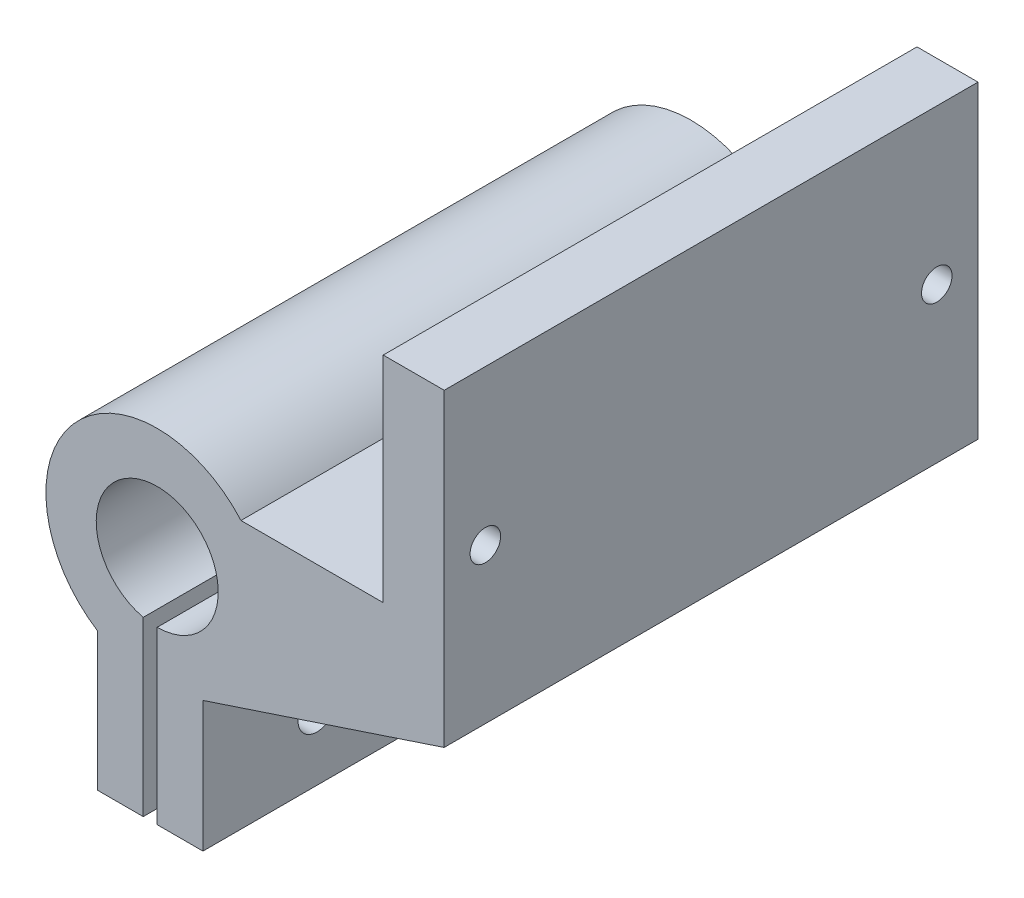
from build123d import *

# Parameters (mm, degrees)
BOSS_EXTRUDE2_DEPTH = 35
SKETCH2_R           = 1
CUT_EXTRUDE1_DEPTH  = 35
SKETCH3_R           = 1.25
CUT_EXTRUDE2_DEPTH  = 35


with BuildPart() as part:
    # Sketch1 → Boss-Extrude2 (new body)
    with BuildSketch(Plane.XY):
        with BuildLine():
            Line((41.590147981, 218.770293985), (37.590147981, 218.770293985))
            Line((37.590147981, 218.770293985), (37.590147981, 204.710145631))
            Line((37.590147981, 204.710145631), (28.261139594, 204.710145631))
            ThreePointArc((28.261139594, 204.710145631), (17.231022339, 204.653976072), (18.853931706, 193.74376036))
            Line((18.853931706, 193.74376036), (18.853931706, 184.689837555))
            Line((18.853931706, 184.689837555), (21.853931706, 184.689837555))
            Line((21.853931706, 184.689837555), (21.853931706, 196.008566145))
            ThreePointArc((21.853931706, 196.008566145), (23.23174559, 203.875464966), (22.770422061, 195.902156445))
            Line((22.770422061, 195.902156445), (22.770422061, 184.689837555))
            Line((22.770422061, 184.689837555), (25.770422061, 184.689837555))
            Line((25.770422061, 184.689837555), (25.770422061, 193.248981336))
            Line((25.770422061, 193.248981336), (41.585057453, 198.483442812))
            Line((41.585057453, 198.483442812), (41.590147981, 218.770293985))
        make_face()
    extrude(amount=BOSS_EXTRUDE2_DEPTH)

    # Sketch2 → Cut-Extrude1 (cut)
    with BuildSketch(Plane(origin=(41.535249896, -0.010422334, 0), x_dir=(0, 0, -1), z_dir=(0.9999999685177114, -0.00025092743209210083, 0))):
        with Locations(Location((-32.3, 208.637297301, 0), (0, 0, 90))):
            Circle(SKETCH2_R)
        with Locations(Location((-2.7, 208.637297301, 0), (0, 0, 270))):
            Circle(SKETCH2_R)
    extrude(amount=-CUT_EXTRUDE1_DEPTH, mode=Mode.SUBTRACT)

    # Sketch3 → Cut-Extrude2 (cut)
    with BuildSketch(Plane(origin=(25.770422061, 0, 0), x_dir=(0, 0, -1), z_dir=(1, 0, 0))):
        with Locations((-7.482464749, 188.969409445)):
            Circle(SKETCH3_R)
        with Locations((-27.517535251, 188.969409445)):
            Circle(SKETCH3_R)
    extrude(amount=-CUT_EXTRUDE2_DEPTH, mode=Mode.SUBTRACT)


solid = part.part
